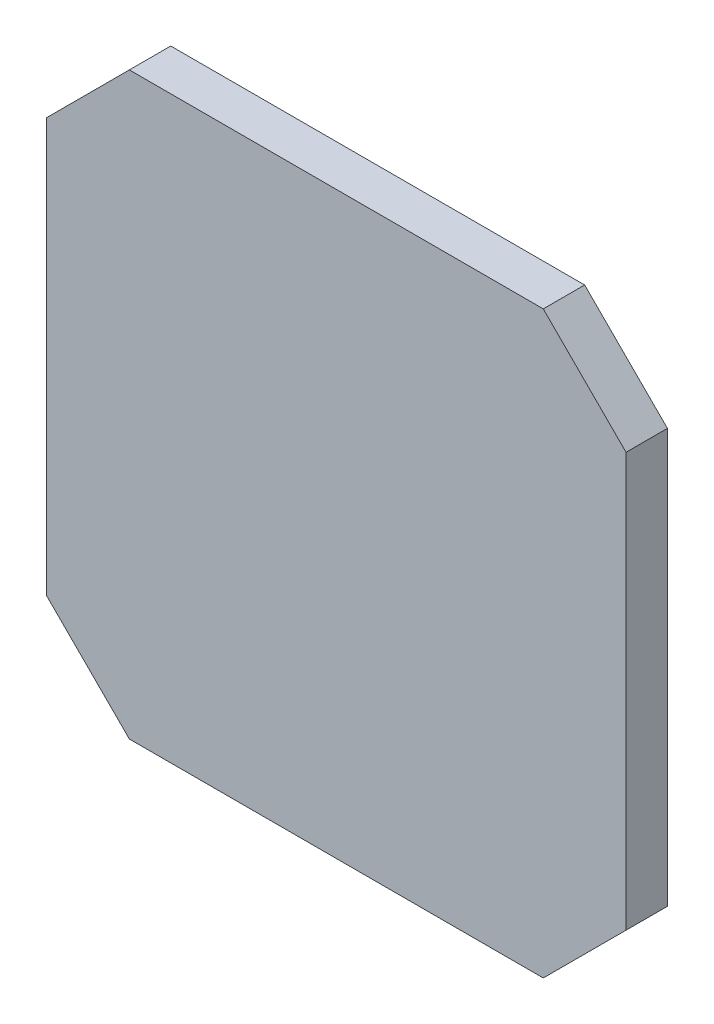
ISO-10303-21;
HEADER;
FILE_DESCRIPTION(('STEP AP214'),'2;1');
FILE_NAME('part.step','',(''),(''),'','','');
FILE_SCHEMA(('AUTOMOTIVE_DESIGN { 1 0 10303 214 1 1 1 1 }'));
ENDSEC;
DATA;
#1=APPLICATION_CONTEXT('core data for automotive mechanical design processes');
#2=APPLICATION_PROTOCOL_DEFINITION('international standard','automotive_design',2000,#1);
#3=PRODUCT_CONTEXT('',#1,'mechanical');
#4=PRODUCT('Part','Part','',(#3));
#5=PRODUCT_RELATED_PRODUCT_CATEGORY('part','',(#4));
#6=PRODUCT_DEFINITION_FORMATION('','',#4);
#7=PRODUCT_DEFINITION_CONTEXT('part definition',#1,'design');
#8=PRODUCT_DEFINITION('design','',#6,#7);
#9=PRODUCT_DEFINITION_SHAPE('','',#8);
#10=(LENGTH_UNIT() NAMED_UNIT(*) SI_UNIT(.MILLI.,.METRE.));
#11=(NAMED_UNIT(*) PLANE_ANGLE_UNIT() SI_UNIT($,.RADIAN.));
#12=(NAMED_UNIT(*) SI_UNIT($,.STERADIAN.) SOLID_ANGLE_UNIT());
#13=UNCERTAINTY_MEASURE_WITH_UNIT(LENGTH_MEASURE(1.E-05),#10,'distance_accuracy_value','');
#14=(GEOMETRIC_REPRESENTATION_CONTEXT(3) GLOBAL_UNCERTAINTY_ASSIGNED_CONTEXT((#13)) GLOBAL_UNIT_ASSIGNED_CONTEXT((#10,
#11,#12)) REPRESENTATION_CONTEXT('',''));
#15=CARTESIAN_POINT('',(0.,0.,0.));
#16=DIRECTION('',(0.,0.,1.));
#17=DIRECTION('',(1.,0.,0.));
#18=AXIS2_PLACEMENT_3D('',#15,#16,#17);
#19=CARTESIAN_POINT('',(10.,0.,5.));
#20=DIRECTION('',(0.,-1.,0.));
#21=DIRECTION('',(0.,0.,-1.));
#22=AXIS2_PLACEMENT_3D('',#19,#20,#21);
#23=PLANE('',#22);
#24=DIRECTION('',(-1.,0.,0.));
#25=VECTOR('',#24,1.);
#26=CARTESIAN_POINT('',(10.,0.,0.));
#27=LINE('',#26,#25);
#28=CARTESIAN_POINT('',(60.,0.,0.));
#29=VERTEX_POINT('',#28);
#30=CARTESIAN_POINT('',(10.,0.,0.));
#31=VERTEX_POINT('',#30);
#32=EDGE_CURVE('E95',#29,#31,#27,.T.);
#33=ORIENTED_EDGE('',*,*,#32,.T.);
#34=DIRECTION('',(0.,0.,-1.));
#35=VECTOR('',#34,1.);
#36=CARTESIAN_POINT('',(10.,0.,5.));
#37=LINE('',#36,#35);
#38=CARTESIAN_POINT('',(10.,0.,5.));
#39=VERTEX_POINT('',#38);
#40=EDGE_CURVE('E11',#39,#31,#37,.T.);
#41=ORIENTED_EDGE('',*,*,#40,.F.);
#42=DIRECTION('',(-1.,0.,0.));
#43=VECTOR('',#42,1.);
#44=CARTESIAN_POINT('',(10.,0.,5.));
#45=LINE('',#44,#43);
#46=CARTESIAN_POINT('',(60.,0.,5.));
#47=VERTEX_POINT('',#46);
#48=EDGE_CURVE('E122',#47,#39,#45,.T.);
#49=ORIENTED_EDGE('',*,*,#48,.F.);
#50=DIRECTION('',(0.,0.,-1.));
#51=VECTOR('',#50,1.);
#52=CARTESIAN_POINT('',(60.,0.,5.));
#53=LINE('',#52,#51);
#54=EDGE_CURVE('E108',#47,#29,#53,.T.);
#55=ORIENTED_EDGE('',*,*,#54,.T.);
#56=EDGE_LOOP('',(#33,#41,#49,#55));
#57=FACE_BOUND('',#56,.T.);
#58=ADVANCED_FACE('F27',(#57),#23,.F.);
#59=CARTESIAN_POINT('',(0.,-10.,5.));
#60=DIRECTION('',(0.707106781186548,-0.707106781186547,0.));
#61=DIRECTION('',(0.707106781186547,0.707106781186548,0.));
#62=AXIS2_PLACEMENT_3D('',#59,#60,#61);
#63=PLANE('',#62);
#64=DIRECTION('',(-0.707106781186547,-0.707106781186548,0.));
#65=VECTOR('',#64,1.);
#66=CARTESIAN_POINT('',(0.,-10.,0.));
#67=LINE('',#66,#65);
#68=CARTESIAN_POINT('',(0.,-10.,0.));
#69=VERTEX_POINT('',#68);
#70=EDGE_CURVE('E91',#31,#69,#67,.T.);
#71=ORIENTED_EDGE('',*,*,#70,.T.);
#72=DIRECTION('',(0.,0.,-1.));
#73=VECTOR('',#72,1.);
#74=CARTESIAN_POINT('',(0.,-10.,5.));
#75=LINE('',#74,#73);
#76=CARTESIAN_POINT('',(0.,-10.,5.));
#77=VERTEX_POINT('',#76);
#78=EDGE_CURVE('E34',#77,#69,#75,.T.);
#79=ORIENTED_EDGE('',*,*,#78,.F.);
#80=DIRECTION('',(-0.707106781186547,-0.707106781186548,0.));
#81=VECTOR('',#80,1.);
#82=CARTESIAN_POINT('',(0.,-10.,5.));
#83=LINE('',#82,#81);
#84=EDGE_CURVE('E104',#39,#77,#83,.T.);
#85=ORIENTED_EDGE('',*,*,#84,.F.);
#86=ORIENTED_EDGE('',*,*,#40,.T.);
#87=EDGE_LOOP('',(#71,#79,#85,#86));
#88=FACE_BOUND('',#87,.T.);
#89=ADVANCED_FACE('F103',(#88),#63,.F.);
#90=CARTESIAN_POINT('',(0.,-10.,5.));
#91=DIRECTION('',(1.,0.,0.));
#92=DIRECTION('',(0.,1.,0.));
#93=AXIS2_PLACEMENT_3D('',#90,#91,#92);
#94=PLANE('',#93);
#95=DIRECTION('',(0.,-1.,0.));
#96=VECTOR('',#95,1.);
#97=CARTESIAN_POINT('',(0.,-10.,0.));
#98=LINE('',#97,#96);
#99=CARTESIAN_POINT('',(0.,-60.,0.));
#100=VERTEX_POINT('',#99);
#101=EDGE_CURVE('E97',#69,#100,#98,.T.);
#102=ORIENTED_EDGE('',*,*,#101,.T.);
#103=DIRECTION('',(0.,0.,-1.));
#104=VECTOR('',#103,1.);
#105=CARTESIAN_POINT('',(0.,-60.,5.));
#106=LINE('',#105,#104);
#107=CARTESIAN_POINT('',(0.,-60.,5.));
#108=VERTEX_POINT('',#107);
#109=EDGE_CURVE('E148',#108,#100,#106,.T.);
#110=ORIENTED_EDGE('',*,*,#109,.F.);
#111=DIRECTION('',(0.,-1.,0.));
#112=VECTOR('',#111,1.);
#113=CARTESIAN_POINT('',(0.,-10.,5.));
#114=LINE('',#113,#112);
#115=EDGE_CURVE('E125',#77,#108,#114,.T.);
#116=ORIENTED_EDGE('',*,*,#115,.F.);
#117=ORIENTED_EDGE('',*,*,#78,.T.);
#118=EDGE_LOOP('',(#102,#110,#116,#117));
#119=FACE_BOUND('',#118,.T.);
#120=ADVANCED_FACE('F152',(#119),#94,.F.);
#121=CARTESIAN_POINT('',(0.,-60.,5.));
#122=DIRECTION('',(0.707106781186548,0.707106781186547,0.));
#123=DIRECTION('',(-0.707106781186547,0.707106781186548,0.));
#124=AXIS2_PLACEMENT_3D('',#121,#122,#123);
#125=PLANE('',#124);
#126=DIRECTION('',(0.707106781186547,-0.707106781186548,0.));
#127=VECTOR('',#126,1.);
#128=CARTESIAN_POINT('',(0.,-60.,0.));
#129=LINE('',#128,#127);
#130=CARTESIAN_POINT('',(10.,-70.,0.));
#131=VERTEX_POINT('',#130);
#132=EDGE_CURVE('E112',#100,#131,#129,.T.);
#133=ORIENTED_EDGE('',*,*,#132,.T.);
#134=DIRECTION('',(0.,0.,-1.));
#135=VECTOR('',#134,1.);
#136=CARTESIAN_POINT('',(10.,-70.,5.));
#137=LINE('',#136,#135);
#138=CARTESIAN_POINT('',(10.,-70.,5.));
#139=VERTEX_POINT('',#138);
#140=EDGE_CURVE('E145',#139,#131,#137,.T.);
#141=ORIENTED_EDGE('',*,*,#140,.F.);
#142=DIRECTION('',(0.707106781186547,-0.707106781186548,0.));
#143=VECTOR('',#142,1.);
#144=CARTESIAN_POINT('',(0.,-60.,5.));
#145=LINE('',#144,#143);
#146=EDGE_CURVE('E127',#108,#139,#145,.T.);
#147=ORIENTED_EDGE('',*,*,#146,.F.);
#148=ORIENTED_EDGE('',*,*,#109,.T.);
#149=EDGE_LOOP('',(#133,#141,#147,#148));
#150=FACE_BOUND('',#149,.T.);
#151=ADVANCED_FACE('F160',(#150),#125,.F.);
#152=CARTESIAN_POINT('',(10.,-70.,5.));
#153=DIRECTION('',(0.,1.,0.));
#154=DIRECTION('',(0.,0.,1.));
#155=AXIS2_PLACEMENT_3D('',#152,#153,#154);
#156=PLANE('',#155);
#157=DIRECTION('',(1.,0.,0.));
#158=VECTOR('',#157,1.);
#159=CARTESIAN_POINT('',(10.,-70.,0.));
#160=LINE('',#159,#158);
#161=CARTESIAN_POINT('',(60.,-70.,0.));
#162=VERTEX_POINT('',#161);
#163=EDGE_CURVE('E114',#131,#162,#160,.T.);
#164=ORIENTED_EDGE('',*,*,#163,.T.);
#165=DIRECTION('',(0.,0.,-1.));
#166=VECTOR('',#165,1.);
#167=CARTESIAN_POINT('',(60.,-70.,5.));
#168=LINE('',#167,#166);
#169=CARTESIAN_POINT('',(60.,-70.,5.));
#170=VERTEX_POINT('',#169);
#171=EDGE_CURVE('E142',#170,#162,#168,.T.);
#172=ORIENTED_EDGE('',*,*,#171,.F.);
#173=DIRECTION('',(1.,0.,0.));
#174=VECTOR('',#173,1.);
#175=CARTESIAN_POINT('',(10.,-70.,5.));
#176=LINE('',#175,#174);
#177=EDGE_CURVE('E129',#139,#170,#176,.T.);
#178=ORIENTED_EDGE('',*,*,#177,.F.);
#179=ORIENTED_EDGE('',*,*,#140,.T.);
#180=EDGE_LOOP('',(#164,#172,#178,#179));
#181=FACE_BOUND('',#180,.T.);
#182=ADVANCED_FACE('F163',(#181),#156,.F.);
#183=CARTESIAN_POINT('',(60.,-70.,5.));
#184=DIRECTION('',(-0.707106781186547,0.707106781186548,0.));
#185=DIRECTION('',(-0.707106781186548,-0.707106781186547,0.));
#186=AXIS2_PLACEMENT_3D('',#183,#184,#185);
#187=PLANE('',#186);
#188=DIRECTION('',(0.707106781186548,0.707106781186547,0.));
#189=VECTOR('',#188,1.);
#190=CARTESIAN_POINT('',(60.,-70.,0.));
#191=LINE('',#190,#189);
#192=CARTESIAN_POINT('',(70.,-60.,0.));
#193=VERTEX_POINT('',#192);
#194=EDGE_CURVE('E116',#162,#193,#191,.T.);
#195=ORIENTED_EDGE('',*,*,#194,.T.);
#196=DIRECTION('',(0.,0.,-1.));
#197=VECTOR('',#196,1.);
#198=CARTESIAN_POINT('',(70.,-60.,5.));
#199=LINE('',#198,#197);
#200=CARTESIAN_POINT('',(70.,-60.,5.));
#201=VERTEX_POINT('',#200);
#202=EDGE_CURVE('E139',#201,#193,#199,.T.);
#203=ORIENTED_EDGE('',*,*,#202,.F.);
#204=DIRECTION('',(0.707106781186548,0.707106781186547,0.));
#205=VECTOR('',#204,1.);
#206=CARTESIAN_POINT('',(60.,-70.,5.));
#207=LINE('',#206,#205);
#208=EDGE_CURVE('E131',#170,#201,#207,.T.);
#209=ORIENTED_EDGE('',*,*,#208,.F.);
#210=ORIENTED_EDGE('',*,*,#171,.T.);
#211=EDGE_LOOP('',(#195,#203,#209,#210));
#212=FACE_BOUND('',#211,.T.);
#213=ADVANCED_FACE('F168',(#212),#187,.F.);
#214=CARTESIAN_POINT('',(70.,-10.,5.));
#215=DIRECTION('',(-1.,0.,0.));
#216=DIRECTION('',(0.,-1.,0.));
#217=AXIS2_PLACEMENT_3D('',#214,#215,#216);
#218=PLANE('',#217);
#219=DIRECTION('',(0.,1.,0.));
#220=VECTOR('',#219,1.);
#221=CARTESIAN_POINT('',(70.,-10.,0.));
#222=LINE('',#221,#220);
#223=CARTESIAN_POINT('',(70.,-10.,0.));
#224=VERTEX_POINT('',#223);
#225=EDGE_CURVE('E118',#193,#224,#222,.T.);
#226=ORIENTED_EDGE('',*,*,#225,.T.);
#227=DIRECTION('',(0.,0.,-1.));
#228=VECTOR('',#227,1.);
#229=CARTESIAN_POINT('',(70.,-10.,5.));
#230=LINE('',#229,#228);
#231=CARTESIAN_POINT('',(70.,-10.,5.));
#232=VERTEX_POINT('',#231);
#233=EDGE_CURVE('E136',#232,#224,#230,.T.);
#234=ORIENTED_EDGE('',*,*,#233,.F.);
#235=DIRECTION('',(0.,1.,0.));
#236=VECTOR('',#235,1.);
#237=CARTESIAN_POINT('',(70.,-10.,5.));
#238=LINE('',#237,#236);
#239=EDGE_CURVE('E46',#201,#232,#238,.T.);
#240=ORIENTED_EDGE('',*,*,#239,.F.);
#241=ORIENTED_EDGE('',*,*,#202,.T.);
#242=EDGE_LOOP('',(#226,#234,#240,#241));
#243=FACE_BOUND('',#242,.T.);
#244=ADVANCED_FACE('F171',(#243),#218,.F.);
#245=CARTESIAN_POINT('',(60.,0.,5.));
#246=DIRECTION('',(-0.707106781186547,-0.707106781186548,0.));
#247=DIRECTION('',(0.707106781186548,-0.707106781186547,0.));
#248=AXIS2_PLACEMENT_3D('',#245,#246,#247);
#249=PLANE('',#248);
#250=DIRECTION('',(-0.707106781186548,0.707106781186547,0.));
#251=VECTOR('',#250,1.);
#252=CARTESIAN_POINT('',(60.,0.,0.));
#253=LINE('',#252,#251);
#254=EDGE_CURVE('E120',#224,#29,#253,.T.);
#255=ORIENTED_EDGE('',*,*,#254,.T.);
#256=ORIENTED_EDGE('',*,*,#54,.F.);
#257=DIRECTION('',(-0.707106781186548,0.707106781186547,0.));
#258=VECTOR('',#257,1.);
#259=CARTESIAN_POINT('',(60.,0.,5.));
#260=LINE('',#259,#258);
#261=EDGE_CURVE('E41',#232,#47,#260,.T.);
#262=ORIENTED_EDGE('',*,*,#261,.F.);
#263=ORIENTED_EDGE('',*,*,#233,.T.);
#264=EDGE_LOOP('',(#255,#256,#262,#263));
#265=FACE_BOUND('',#264,.T.);
#266=ADVANCED_FACE('F173',(#265),#249,.F.);
#267=CARTESIAN_POINT('',(0.,0.,5.));
#268=DIRECTION('',(0.,0.,-1.));
#269=DIRECTION('',(-1.,0.,0.));
#270=AXIS2_PLACEMENT_3D('',#267,#268,#269);
#271=PLANE('',#270);
#272=ORIENTED_EDGE('',*,*,#48,.T.);
#273=ORIENTED_EDGE('',*,*,#84,.T.);
#274=ORIENTED_EDGE('',*,*,#115,.T.);
#275=ORIENTED_EDGE('',*,*,#146,.T.);
#276=ORIENTED_EDGE('',*,*,#177,.T.);
#277=ORIENTED_EDGE('',*,*,#208,.T.);
#278=ORIENTED_EDGE('',*,*,#239,.T.);
#279=ORIENTED_EDGE('',*,*,#261,.T.);
#280=EDGE_LOOP('',(#272,#273,#274,#275,#276,#277,#278,#279));
#281=FACE_BOUND('',#280,.T.);
#282=ADVANCED_FACE('F155',(#281),#271,.F.);
#283=CARTESIAN_POINT('',(0.,0.,0.));
#284=DIRECTION('',(0.,0.,-1.));
#285=DIRECTION('',(-1.,0.,0.));
#286=AXIS2_PLACEMENT_3D('',#283,#284,#285);
#287=PLANE('',#286);
#288=ORIENTED_EDGE('',*,*,#32,.F.);
#289=ORIENTED_EDGE('',*,*,#254,.F.);
#290=ORIENTED_EDGE('',*,*,#225,.F.);
#291=ORIENTED_EDGE('',*,*,#194,.F.);
#292=ORIENTED_EDGE('',*,*,#163,.F.);
#293=ORIENTED_EDGE('',*,*,#132,.F.);
#294=ORIENTED_EDGE('',*,*,#101,.F.);
#295=ORIENTED_EDGE('',*,*,#70,.F.);
#296=EDGE_LOOP('',(#288,#289,#290,#291,#292,#293,#294,#295));
#297=FACE_BOUND('',#296,.T.);
#298=ADVANCED_FACE('F92',(#297),#287,.T.);
#299=CLOSED_SHELL('',(#58,#89,#120,#151,#182,#213,#244,#266,#282,#298));
#300=MANIFOLD_SOLID_BREP('B2',#299);
#301=ADVANCED_BREP_SHAPE_REPRESENTATION('',(#18,#300),#14);
#302=SHAPE_DEFINITION_REPRESENTATION(#9,#301);
ENDSEC;
END-ISO-10303-21;
